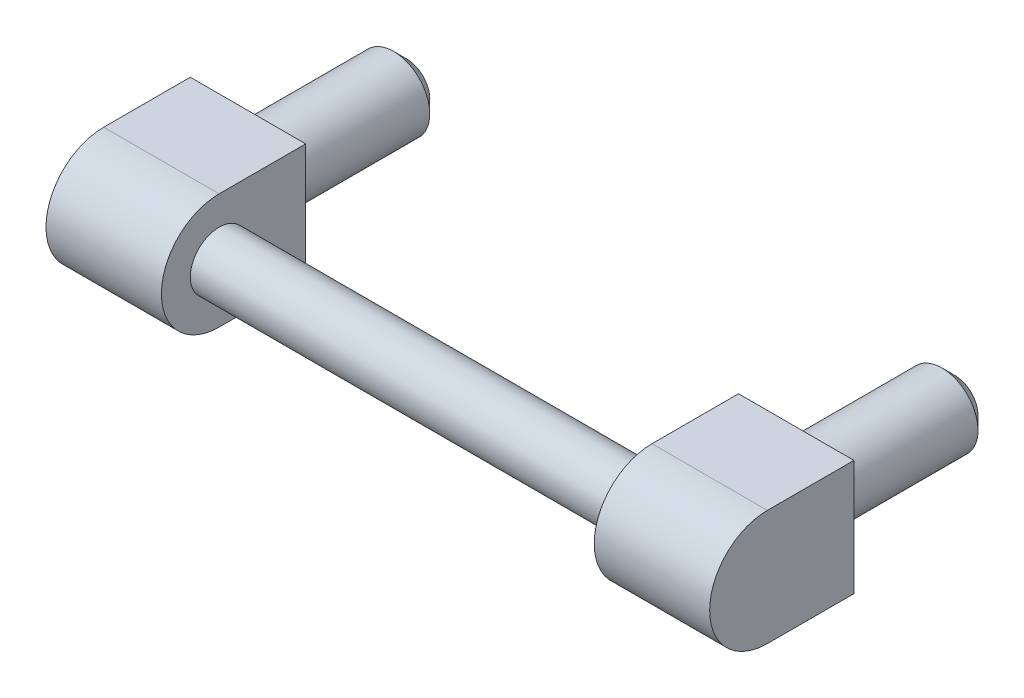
ISO-10303-21;
HEADER;
FILE_DESCRIPTION(('STEP AP214'),'2;1');
FILE_NAME('part.step','',(''),(''),'','','');
FILE_SCHEMA(('AUTOMOTIVE_DESIGN { 1 0 10303 214 1 1 1 1 }'));
ENDSEC;
DATA;
#1=APPLICATION_CONTEXT('core data for automotive mechanical design processes');
#2=APPLICATION_PROTOCOL_DEFINITION('international standard','automotive_design',2000,#1);
#3=PRODUCT_CONTEXT('',#1,'mechanical');
#4=PRODUCT('Part','Part','',(#3));
#5=PRODUCT_RELATED_PRODUCT_CATEGORY('part','',(#4));
#6=PRODUCT_DEFINITION_FORMATION('','',#4);
#7=PRODUCT_DEFINITION_CONTEXT('part definition',#1,'design');
#8=PRODUCT_DEFINITION('design','',#6,#7);
#9=PRODUCT_DEFINITION_SHAPE('','',#8);
#10=(LENGTH_UNIT() NAMED_UNIT(*) SI_UNIT(.MILLI.,.METRE.));
#11=(NAMED_UNIT(*) PLANE_ANGLE_UNIT() SI_UNIT($,.RADIAN.));
#12=(NAMED_UNIT(*) SI_UNIT($,.STERADIAN.) SOLID_ANGLE_UNIT());
#13=UNCERTAINTY_MEASURE_WITH_UNIT(LENGTH_MEASURE(1.E-05),#10,'distance_accuracy_value','');
#14=(GEOMETRIC_REPRESENTATION_CONTEXT(3) GLOBAL_UNCERTAINTY_ASSIGNED_CONTEXT((#13)) GLOBAL_UNIT_ASSIGNED_CONTEXT((#10,
#11,#12)) REPRESENTATION_CONTEXT('',''));
#15=CARTESIAN_POINT('',(0.,0.,0.));
#16=DIRECTION('',(0.,0.,1.));
#17=DIRECTION('',(1.,0.,0.));
#18=AXIS2_PLACEMENT_3D('',#15,#16,#17);
#19=CARTESIAN_POINT('',(0.,0.,-11.));
#20=DIRECTION('',(0.,0.,1.));
#21=DIRECTION('',(0.,-1.,0.));
#22=AXIS2_PLACEMENT_3D('',#19,#20,#21);
#23=CYLINDRICAL_SURFACE('',#22,2.5);
#24=CARTESIAN_POINT('',(0.,0.,-10.1));
#25=DIRECTION('',(0.,0.,1.));
#26=DIRECTION('',(0.,-1.,0.));
#27=AXIS2_PLACEMENT_3D('',#24,#25,#26);
#28=CIRCLE('',#27,2.5);
#29=CARTESIAN_POINT('',(0.,-2.50000000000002,-10.1));
#30=VERTEX_POINT('',#29);
#31=EDGE_CURVE('E130',#30,#30,#28,.T.);
#32=ORIENTED_EDGE('',*,*,#31,.T.);
#33=EDGE_LOOP('',(#32));
#34=FACE_BOUND('',#33,.T.);
#35=CARTESIAN_POINT('',(0.,0.,0.));
#36=DIRECTION('',(0.,0.,1.));
#37=DIRECTION('',(0.,-1.,0.));
#38=AXIS2_PLACEMENT_3D('',#35,#36,#37);
#39=CIRCLE('',#38,2.5);
#40=CARTESIAN_POINT('',(0.,-2.5,0.));
#41=VERTEX_POINT('',#40);
#42=EDGE_CURVE('E131',#41,#41,#39,.T.);
#43=ORIENTED_EDGE('',*,*,#42,.F.);
#44=EDGE_LOOP('',(#43));
#45=FACE_BOUND('',#44,.T.);
#46=ADVANCED_FACE('F14',(#34,#45),#23,.T.);
#47=CARTESIAN_POINT('',(0.,0.,-11.));
#48=DIRECTION('',(0.,0.,1.));
#49=DIRECTION('',(0.,-1.,0.));
#50=AXIS2_PLACEMENT_3D('',#47,#48,#49);
#51=PLANE('',#50);
#52=CARTESIAN_POINT('',(0.,0.,-11.));
#53=DIRECTION('',(0.,0.,1.));
#54=DIRECTION('',(0.,-1.,0.));
#55=AXIS2_PLACEMENT_3D('',#52,#53,#54);
#56=CIRCLE('',#55,1.6);
#57=CARTESIAN_POINT('',(0.,-1.60000000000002,-11.));
#58=VERTEX_POINT('',#57);
#59=EDGE_CURVE('E163',#58,#58,#56,.F.);
#60=ORIENTED_EDGE('',*,*,#59,.T.);
#61=EDGE_LOOP('',(#60));
#62=FACE_BOUND('',#61,.T.);
#63=ADVANCED_FACE('F182',(#62),#51,.F.);
#64=CARTESIAN_POINT('',(4.,4.,0.));
#65=DIRECTION('',(0.,0.,-1.));
#66=DIRECTION('',(0.,1.,0.));
#67=AXIS2_PLACEMENT_3D('',#64,#65,#66);
#68=PLANE('',#67);
#69=ORIENTED_EDGE('',*,*,#42,.T.);
#70=EDGE_LOOP('',(#69));
#71=FACE_BOUND('',#70,.T.);
#72=DIRECTION('',(-1.,0.,0.));
#73=VECTOR('',#72,1.);
#74=CARTESIAN_POINT('',(4.,4.,0.));
#75=LINE('',#74,#73);
#76=CARTESIAN_POINT('',(4.,4.,0.));
#77=VERTEX_POINT('',#76);
#78=CARTESIAN_POINT('',(-4.,4.,0.));
#79=VERTEX_POINT('',#78);
#80=EDGE_CURVE('E29',#77,#79,#75,.T.);
#81=ORIENTED_EDGE('',*,*,#80,.F.);
#82=DIRECTION('',(0.,-1.,0.));
#83=VECTOR('',#82,1.);
#84=CARTESIAN_POINT('',(4.,4.,0.));
#85=LINE('',#84,#83);
#86=CARTESIAN_POINT('',(4.,-4.,0.));
#87=VERTEX_POINT('',#86);
#88=EDGE_CURVE('E142',#77,#87,#85,.T.);
#89=ORIENTED_EDGE('',*,*,#88,.T.);
#90=DIRECTION('',(-1.,0.,0.));
#91=VECTOR('',#90,1.);
#92=CARTESIAN_POINT('',(4.,-4.,0.));
#93=LINE('',#92,#91);
#94=CARTESIAN_POINT('',(-4.,-4.,0.));
#95=VERTEX_POINT('',#94);
#96=EDGE_CURVE('E153',#87,#95,#93,.T.);
#97=ORIENTED_EDGE('',*,*,#96,.T.);
#98=DIRECTION('',(0.,-1.,0.));
#99=VECTOR('',#98,1.);
#100=CARTESIAN_POINT('',(-4.,4.,0.));
#101=LINE('',#100,#99);
#102=EDGE_CURVE('E126',#79,#95,#101,.T.);
#103=ORIENTED_EDGE('',*,*,#102,.F.);
#104=EDGE_LOOP('',(#81,#89,#97,#103));
#105=FACE_BOUND('',#104,.T.);
#106=ADVANCED_FACE('F184',(#71,#105),#68,.T.);
#107=CARTESIAN_POINT('',(4.,4.,0.));
#108=DIRECTION('',(0.,-1.,0.));
#109=DIRECTION('',(0.,0.,-1.));
#110=AXIS2_PLACEMENT_3D('',#107,#108,#109);
#111=PLANE('',#110);
#112=DIRECTION('',(-1.,0.,0.));
#113=VECTOR('',#112,1.);
#114=CARTESIAN_POINT('',(4.,4.,6.));
#115=LINE('',#114,#113);
#116=CARTESIAN_POINT('',(4.,4.,6.));
#117=VERTEX_POINT('',#116);
#118=CARTESIAN_POINT('',(-4.,4.,6.));
#119=VERTEX_POINT('',#118);
#120=EDGE_CURVE('E37',#117,#119,#115,.T.);
#121=ORIENTED_EDGE('',*,*,#120,.F.);
#122=DIRECTION('',(0.,0.,1.));
#123=VECTOR('',#122,1.);
#124=CARTESIAN_POINT('',(4.,4.,0.));
#125=LINE('',#124,#123);
#126=EDGE_CURVE('E150',#77,#117,#125,.T.);
#127=ORIENTED_EDGE('',*,*,#126,.F.);
#128=ORIENTED_EDGE('',*,*,#80,.T.);
#129=DIRECTION('',(0.,0.,1.));
#130=VECTOR('',#129,1.);
#131=CARTESIAN_POINT('',(-4.,4.,0.));
#132=LINE('',#131,#130);
#133=EDGE_CURVE('E140',#79,#119,#132,.T.);
#134=ORIENTED_EDGE('',*,*,#133,.T.);
#135=EDGE_LOOP('',(#121,#127,#128,#134));
#136=FACE_BOUND('',#135,.T.);
#137=ADVANCED_FACE('F192',(#136),#111,.F.);
#138=CARTESIAN_POINT('',(4.,0.,6.));
#139=DIRECTION('',(-1.,0.,0.));
#140=DIRECTION('',(0.,0.,-1.));
#141=AXIS2_PLACEMENT_3D('',#138,#139,#140);
#142=CYLINDRICAL_SURFACE('',#141,4.);
#143=DIRECTION('',(-1.,0.,0.));
#144=VECTOR('',#143,1.);
#145=CARTESIAN_POINT('',(4.,-4.,6.));
#146=LINE('',#145,#144);
#147=CARTESIAN_POINT('',(4.,-4.,6.));
#148=VERTEX_POINT('',#147);
#149=CARTESIAN_POINT('',(-4.,-4.,6.));
#150=VERTEX_POINT('',#149);
#151=EDGE_CURVE('E155',#148,#150,#146,.T.);
#152=ORIENTED_EDGE('',*,*,#151,.F.);
#153=CARTESIAN_POINT('',(4.,0.,6.));
#154=DIRECTION('',(1.,0.,0.));
#155=DIRECTION('',(0.,0.,1.));
#156=AXIS2_PLACEMENT_3D('',#153,#154,#155);
#157=CIRCLE('',#156,4.);
#158=EDGE_CURVE('E147',#117,#148,#157,.T.);
#159=ORIENTED_EDGE('',*,*,#158,.F.);
#160=ORIENTED_EDGE('',*,*,#120,.T.);
#161=CARTESIAN_POINT('',(-4.,0.,6.));
#162=DIRECTION('',(1.,0.,0.));
#163=DIRECTION('',(0.,0.,1.));
#164=AXIS2_PLACEMENT_3D('',#161,#162,#163);
#165=CIRCLE('',#164,4.);
#166=EDGE_CURVE('E137',#119,#150,#165,.T.);
#167=ORIENTED_EDGE('',*,*,#166,.T.);
#168=EDGE_LOOP('',(#152,#159,#160,#167));
#169=FACE_BOUND('',#168,.T.);
#170=ADVANCED_FACE('F200',(#169),#142,.T.);
#171=CARTESIAN_POINT('',(4.,-4.,0.));
#172=DIRECTION('',(0.,-1.,0.));
#173=DIRECTION('',(0.,0.,-1.));
#174=AXIS2_PLACEMENT_3D('',#171,#172,#173);
#175=PLANE('',#174);
#176=DIRECTION('',(0.,0.,1.));
#177=VECTOR('',#176,1.);
#178=CARTESIAN_POINT('',(4.,-4.,0.));
#179=LINE('',#178,#177);
#180=EDGE_CURVE('E144',#87,#148,#179,.T.);
#181=ORIENTED_EDGE('',*,*,#180,.T.);
#182=ORIENTED_EDGE('',*,*,#151,.T.);
#183=DIRECTION('',(0.,0.,1.));
#184=VECTOR('',#183,1.);
#185=CARTESIAN_POINT('',(-4.,-4.,0.));
#186=LINE('',#185,#184);
#187=EDGE_CURVE('E134',#95,#150,#186,.T.);
#188=ORIENTED_EDGE('',*,*,#187,.F.);
#189=ORIENTED_EDGE('',*,*,#96,.F.);
#190=EDGE_LOOP('',(#181,#182,#188,#189));
#191=FACE_BOUND('',#190,.T.);
#192=ADVANCED_FACE('F203',(#191),#175,.T.);
#193=CARTESIAN_POINT('',(4.,0.,6.));
#194=DIRECTION('',(1.,0.,0.));
#195=DIRECTION('',(0.,0.,1.));
#196=AXIS2_PLACEMENT_3D('',#193,#194,#195);
#197=PLANE('',#196);
#198=CARTESIAN_POINT('',(4.,0.,6.));
#199=DIRECTION('',(1.,0.,0.));
#200=DIRECTION('',(0.,0.,1.));
#201=AXIS2_PLACEMENT_3D('',#198,#199,#200);
#202=CIRCLE('',#201,2.);
#203=CARTESIAN_POINT('',(4.,0.,8.));
#204=VERTEX_POINT('',#203);
#205=EDGE_CURVE('E127',#204,#204,#202,.T.);
#206=ORIENTED_EDGE('',*,*,#205,.F.);
#207=EDGE_LOOP('',(#206));
#208=FACE_BOUND('',#207,.T.);
#209=ORIENTED_EDGE('',*,*,#88,.F.);
#210=ORIENTED_EDGE('',*,*,#126,.T.);
#211=ORIENTED_EDGE('',*,*,#158,.T.);
#212=ORIENTED_EDGE('',*,*,#180,.F.);
#213=EDGE_LOOP('',(#209,#210,#211,#212));
#214=FACE_BOUND('',#213,.T.);
#215=ADVANCED_FACE('F205',(#208,#214),#197,.T.);
#216=CARTESIAN_POINT('',(-4.,0.,6.));
#217=DIRECTION('',(1.,0.,0.));
#218=DIRECTION('',(0.,0.,1.));
#219=AXIS2_PLACEMENT_3D('',#216,#217,#218);
#220=PLANE('',#219);
#221=ORIENTED_EDGE('',*,*,#102,.T.);
#222=ORIENTED_EDGE('',*,*,#187,.T.);
#223=ORIENTED_EDGE('',*,*,#166,.F.);
#224=ORIENTED_EDGE('',*,*,#133,.F.);
#225=EDGE_LOOP('',(#221,#222,#223,#224));
#226=FACE_BOUND('',#225,.T.);
#227=ADVANCED_FACE('F208',(#226),#220,.F.);
#228=CARTESIAN_POINT('',(19.,0.,6.));
#229=DIRECTION('',(-1.,0.,0.));
#230=DIRECTION('',(0.,0.,-1.));
#231=AXIS2_PLACEMENT_3D('',#228,#229,#230);
#232=CYLINDRICAL_SURFACE('',#231,2.);
#233=ORIENTED_EDGE('',*,*,#205,.T.);
#234=EDGE_LOOP('',(#233));
#235=FACE_BOUND('',#234,.T.);
#236=CARTESIAN_POINT('',(34.,0.,6.));
#237=DIRECTION('',(1.,0.,0.));
#238=DIRECTION('',(0.,0.,1.));
#239=AXIS2_PLACEMENT_3D('',#236,#237,#238);
#240=CIRCLE('',#239,2.);
#241=CARTESIAN_POINT('',(34.,0.,8.));
#242=VERTEX_POINT('',#241);
#243=EDGE_CURVE('E123',#242,#242,#240,.T.);
#244=ORIENTED_EDGE('',*,*,#243,.F.);
#245=EDGE_LOOP('',(#244));
#246=FACE_BOUND('',#245,.T.);
#247=ADVANCED_FACE('F215',(#235,#246),#232,.T.);
#248=CARTESIAN_POINT('',(38.,0.,-11.));
#249=DIRECTION('',(0.,0.,1.));
#250=DIRECTION('',(0.,-1.,0.));
#251=AXIS2_PLACEMENT_3D('',#248,#249,#250);
#252=CYLINDRICAL_SURFACE('',#251,2.5);
#253=CARTESIAN_POINT('',(38.,0.,-10.1));
#254=DIRECTION('',(0.,0.,1.));
#255=DIRECTION('',(0.,-1.,0.));
#256=AXIS2_PLACEMENT_3D('',#253,#254,#255);
#257=CIRCLE('',#256,2.5);
#258=CARTESIAN_POINT('',(38.,-2.50000000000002,-10.1));
#259=VERTEX_POINT('',#258);
#260=EDGE_CURVE('E9',#259,#259,#257,.T.);
#261=ORIENTED_EDGE('',*,*,#260,.T.);
#262=EDGE_LOOP('',(#261));
#263=FACE_BOUND('',#262,.T.);
#264=CARTESIAN_POINT('',(38.,0.,0.));
#265=DIRECTION('',(0.,0.,-1.));
#266=DIRECTION('',(0.,-1.,0.));
#267=AXIS2_PLACEMENT_3D('',#264,#265,#266);
#268=CIRCLE('',#267,2.5);
#269=CARTESIAN_POINT('',(38.,-2.5,0.));
#270=VERTEX_POINT('',#269);
#271=EDGE_CURVE('E93',#270,#270,#268,.T.);
#272=ORIENTED_EDGE('',*,*,#271,.T.);
#273=EDGE_LOOP('',(#272));
#274=FACE_BOUND('',#273,.T.);
#275=ADVANCED_FACE('F180',(#263,#274),#252,.T.);
#276=CARTESIAN_POINT('',(38.,0.,-11.));
#277=DIRECTION('',(0.,0.,1.));
#278=DIRECTION('',(0.,-1.,0.));
#279=AXIS2_PLACEMENT_3D('',#276,#277,#278);
#280=PLANE('',#279);
#281=CARTESIAN_POINT('',(38.,0.,-11.));
#282=DIRECTION('',(0.,0.,1.));
#283=DIRECTION('',(0.,-1.,0.));
#284=AXIS2_PLACEMENT_3D('',#281,#282,#283);
#285=CIRCLE('',#284,1.6);
#286=CARTESIAN_POINT('',(38.,-1.60000000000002,-11.));
#287=VERTEX_POINT('',#286);
#288=EDGE_CURVE('E22',#287,#287,#285,.F.);
#289=ORIENTED_EDGE('',*,*,#288,.T.);
#290=EDGE_LOOP('',(#289));
#291=FACE_BOUND('',#290,.T.);
#292=ADVANCED_FACE('F168',(#291),#280,.F.);
#293=CARTESIAN_POINT('',(34.,4.,0.));
#294=DIRECTION('',(0.,0.,-1.));
#295=DIRECTION('',(0.,1.,0.));
#296=AXIS2_PLACEMENT_3D('',#293,#294,#295);
#297=PLANE('',#296);
#298=ORIENTED_EDGE('',*,*,#271,.F.);
#299=EDGE_LOOP('',(#298));
#300=FACE_BOUND('',#299,.T.);
#301=DIRECTION('',(1.,0.,0.));
#302=VECTOR('',#301,1.);
#303=CARTESIAN_POINT('',(34.,4.,0.));
#304=LINE('',#303,#302);
#305=CARTESIAN_POINT('',(34.,4.,0.));
#306=VERTEX_POINT('',#305);
#307=CARTESIAN_POINT('',(42.,4.,0.));
#308=VERTEX_POINT('',#307);
#309=EDGE_CURVE('E81',#306,#308,#304,.T.);
#310=ORIENTED_EDGE('',*,*,#309,.T.);
#311=DIRECTION('',(0.,-1.,0.));
#312=VECTOR('',#311,1.);
#313=CARTESIAN_POINT('',(42.,4.,0.));
#314=LINE('',#313,#312);
#315=CARTESIAN_POINT('',(42.,-4.,0.));
#316=VERTEX_POINT('',#315);
#317=EDGE_CURVE('E109',#308,#316,#314,.T.);
#318=ORIENTED_EDGE('',*,*,#317,.T.);
#319=DIRECTION('',(1.,0.,0.));
#320=VECTOR('',#319,1.);
#321=CARTESIAN_POINT('',(34.,-4.,0.));
#322=LINE('',#321,#320);
#323=CARTESIAN_POINT('',(34.,-4.,0.));
#324=VERTEX_POINT('',#323);
#325=EDGE_CURVE('E97',#324,#316,#322,.T.);
#326=ORIENTED_EDGE('',*,*,#325,.F.);
#327=DIRECTION('',(0.,-1.,0.));
#328=VECTOR('',#327,1.);
#329=CARTESIAN_POINT('',(34.,4.,0.));
#330=LINE('',#329,#328);
#331=EDGE_CURVE('E92',#306,#324,#330,.T.);
#332=ORIENTED_EDGE('',*,*,#331,.F.);
#333=EDGE_LOOP('',(#310,#318,#326,#332));
#334=FACE_BOUND('',#333,.T.);
#335=ADVANCED_FACE('F96',(#300,#334),#297,.T.);
#336=CARTESIAN_POINT('',(34.,4.,0.));
#337=DIRECTION('',(0.,-1.,0.));
#338=DIRECTION('',(0.,0.,-1.));
#339=AXIS2_PLACEMENT_3D('',#336,#337,#338);
#340=PLANE('',#339);
#341=DIRECTION('',(1.,0.,0.));
#342=VECTOR('',#341,1.);
#343=CARTESIAN_POINT('',(34.,4.,6.));
#344=LINE('',#343,#342);
#345=CARTESIAN_POINT('',(34.,4.,6.));
#346=VERTEX_POINT('',#345);
#347=CARTESIAN_POINT('',(42.,4.,6.));
#348=VERTEX_POINT('',#347);
#349=EDGE_CURVE('E105',#346,#348,#344,.T.);
#350=ORIENTED_EDGE('',*,*,#349,.T.);
#351=DIRECTION('',(0.,0.,1.));
#352=VECTOR('',#351,1.);
#353=CARTESIAN_POINT('',(42.,4.,0.));
#354=LINE('',#353,#352);
#355=EDGE_CURVE('E88',#308,#348,#354,.T.);
#356=ORIENTED_EDGE('',*,*,#355,.F.);
#357=ORIENTED_EDGE('',*,*,#309,.F.);
#358=DIRECTION('',(0.,0.,1.));
#359=VECTOR('',#358,1.);
#360=CARTESIAN_POINT('',(34.,4.,0.));
#361=LINE('',#360,#359);
#362=EDGE_CURVE('E85',#306,#346,#361,.T.);
#363=ORIENTED_EDGE('',*,*,#362,.T.);
#364=EDGE_LOOP('',(#350,#356,#357,#363));
#365=FACE_BOUND('',#364,.T.);
#366=ADVANCED_FACE('F83',(#365),#340,.F.);
#367=CARTESIAN_POINT('',(34.,0.,6.));
#368=DIRECTION('',(1.,0.,0.));
#369=DIRECTION('',(0.,0.,-1.));
#370=AXIS2_PLACEMENT_3D('',#367,#368,#369);
#371=CYLINDRICAL_SURFACE('',#370,4.);
#372=DIRECTION('',(1.,0.,0.));
#373=VECTOR('',#372,1.);
#374=CARTESIAN_POINT('',(34.,-4.,6.));
#375=LINE('',#374,#373);
#376=CARTESIAN_POINT('',(34.,-4.,6.));
#377=VERTEX_POINT('',#376);
#378=CARTESIAN_POINT('',(42.,-4.,6.));
#379=VERTEX_POINT('',#378);
#380=EDGE_CURVE('E107',#377,#379,#375,.T.);
#381=ORIENTED_EDGE('',*,*,#380,.T.);
#382=CARTESIAN_POINT('',(42.,0.,6.));
#383=DIRECTION('',(1.,0.,0.));
#384=DIRECTION('',(0.,0.,1.));
#385=AXIS2_PLACEMENT_3D('',#382,#383,#384);
#386=CIRCLE('',#385,4.);
#387=EDGE_CURVE('E115',#348,#379,#386,.T.);
#388=ORIENTED_EDGE('',*,*,#387,.F.);
#389=ORIENTED_EDGE('',*,*,#349,.F.);
#390=CARTESIAN_POINT('',(34.,0.,6.));
#391=DIRECTION('',(1.,0.,0.));
#392=DIRECTION('',(0.,0.,1.));
#393=AXIS2_PLACEMENT_3D('',#390,#391,#392);
#394=CIRCLE('',#393,4.);
#395=EDGE_CURVE('E104',#346,#377,#394,.T.);
#396=ORIENTED_EDGE('',*,*,#395,.T.);
#397=EDGE_LOOP('',(#381,#388,#389,#396));
#398=FACE_BOUND('',#397,.T.);
#399=ADVANCED_FACE('F229',(#398),#371,.T.);
#400=CARTESIAN_POINT('',(34.,-4.,0.));
#401=DIRECTION('',(0.,-1.,0.));
#402=DIRECTION('',(0.,0.,-1.));
#403=AXIS2_PLACEMENT_3D('',#400,#401,#402);
#404=PLANE('',#403);
#405=DIRECTION('',(0.,0.,1.));
#406=VECTOR('',#405,1.);
#407=CARTESIAN_POINT('',(34.,-4.,0.));
#408=LINE('',#407,#406);
#409=EDGE_CURVE('E118',#324,#377,#408,.T.);
#410=ORIENTED_EDGE('',*,*,#409,.F.);
#411=ORIENTED_EDGE('',*,*,#325,.T.);
#412=DIRECTION('',(0.,0.,1.));
#413=VECTOR('',#412,1.);
#414=CARTESIAN_POINT('',(42.,-4.,0.));
#415=LINE('',#414,#413);
#416=EDGE_CURVE('E120',#316,#379,#415,.T.);
#417=ORIENTED_EDGE('',*,*,#416,.T.);
#418=ORIENTED_EDGE('',*,*,#380,.F.);
#419=EDGE_LOOP('',(#410,#411,#417,#418));
#420=FACE_BOUND('',#419,.T.);
#421=ADVANCED_FACE('F225',(#420),#404,.T.);
#422=CARTESIAN_POINT('',(34.,0.,6.));
#423=DIRECTION('',(-1.,0.,0.));
#424=DIRECTION('',(0.,0.,1.));
#425=AXIS2_PLACEMENT_3D('',#422,#423,#424);
#426=PLANE('',#425);
#427=ORIENTED_EDGE('',*,*,#243,.T.);
#428=EDGE_LOOP('',(#427));
#429=FACE_BOUND('',#428,.T.);
#430=ORIENTED_EDGE('',*,*,#331,.T.);
#431=ORIENTED_EDGE('',*,*,#409,.T.);
#432=ORIENTED_EDGE('',*,*,#395,.F.);
#433=ORIENTED_EDGE('',*,*,#362,.F.);
#434=EDGE_LOOP('',(#430,#431,#432,#433));
#435=FACE_BOUND('',#434,.T.);
#436=ADVANCED_FACE('F102',(#429,#435),#426,.T.);
#437=CARTESIAN_POINT('',(42.,0.,6.));
#438=DIRECTION('',(-1.,0.,0.));
#439=DIRECTION('',(0.,0.,1.));
#440=AXIS2_PLACEMENT_3D('',#437,#438,#439);
#441=PLANE('',#440);
#442=ORIENTED_EDGE('',*,*,#317,.F.);
#443=ORIENTED_EDGE('',*,*,#355,.T.);
#444=ORIENTED_EDGE('',*,*,#387,.T.);
#445=ORIENTED_EDGE('',*,*,#416,.F.);
#446=EDGE_LOOP('',(#442,#443,#444,#445));
#447=FACE_BOUND('',#446,.T.);
#448=ADVANCED_FACE('F178',(#447),#441,.F.);
#449=CARTESIAN_POINT('',(0.,0.,-10.1));
#450=DIRECTION('',(0.,0.,1.));
#451=DIRECTION('',(0.,-1.,0.));
#452=AXIS2_PLACEMENT_3D('',#449,#450,#451);
#453=CONICAL_SURFACE('',#452,2.5,0.78539816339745);
#454=ORIENTED_EDGE('',*,*,#59,.F.);
#455=EDGE_LOOP('',(#454));
#456=FACE_BOUND('',#455,.T.);
#457=ORIENTED_EDGE('',*,*,#31,.F.);
#458=EDGE_LOOP('',(#457));
#459=FACE_BOUND('',#458,.T.);
#460=ADVANCED_FACE('F171',(#456,#459),#453,.T.);
#461=CARTESIAN_POINT('',(38.,0.,-11.));
#462=DIRECTION('',(0.,0.,1.));
#463=DIRECTION('',(0.,-1.,0.));
#464=AXIS2_PLACEMENT_3D('',#461,#462,#463);
#465=CONICAL_SURFACE('',#464,1.6,0.785398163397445);
#466=ORIENTED_EDGE('',*,*,#260,.F.);
#467=EDGE_LOOP('',(#466));
#468=FACE_BOUND('',#467,.T.);
#469=ORIENTED_EDGE('',*,*,#288,.F.);
#470=EDGE_LOOP('',(#469));
#471=FACE_BOUND('',#470,.T.);
#472=ADVANCED_FACE('F16',(#468,#471),#465,.T.);
#473=CLOSED_SHELL('',(#46,#63,#106,#137,#170,#192,#215,#227,#247,#275,#292,#335,#366,#399,#421,
#436,#448,#460,#472));
#474=MANIFOLD_SOLID_BREP('B1',#473);
#475=ADVANCED_BREP_SHAPE_REPRESENTATION('',(#18,#474),#14);
#476=SHAPE_DEFINITION_REPRESENTATION(#9,#475);
ENDSEC;
END-ISO-10303-21;
